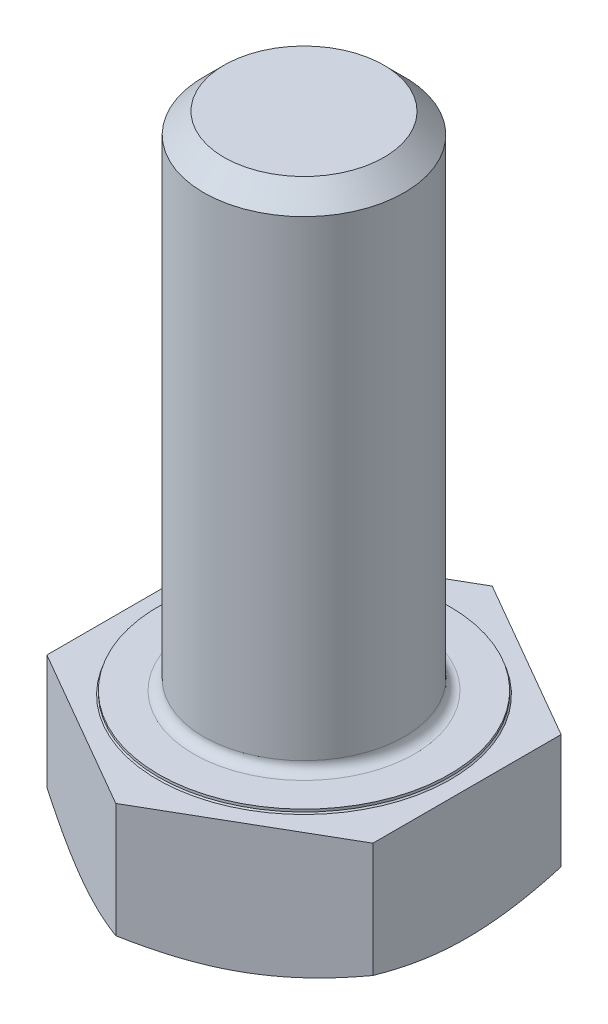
ISO-10303-21;
HEADER;
FILE_DESCRIPTION(('STEP AP214'),'2;1');
FILE_NAME('part.step','',(''),(''),'','','');
FILE_SCHEMA(('AUTOMOTIVE_DESIGN { 1 0 10303 214 1 1 1 1 }'));
ENDSEC;
DATA;
#1=APPLICATION_CONTEXT('core data for automotive mechanical design processes');
#2=APPLICATION_PROTOCOL_DEFINITION('international standard','automotive_design',2000,#1);
#3=PRODUCT_CONTEXT('',#1,'mechanical');
#4=PRODUCT('Part','Part','',(#3));
#5=PRODUCT_RELATED_PRODUCT_CATEGORY('part','',(#4));
#6=PRODUCT_DEFINITION_FORMATION('','',#4);
#7=PRODUCT_DEFINITION_CONTEXT('part definition',#1,'design');
#8=PRODUCT_DEFINITION('design','',#6,#7);
#9=PRODUCT_DEFINITION_SHAPE('','',#8);
#10=(LENGTH_UNIT() NAMED_UNIT(*) SI_UNIT(.MILLI.,.METRE.));
#11=(NAMED_UNIT(*) PLANE_ANGLE_UNIT() SI_UNIT($,.RADIAN.));
#12=(NAMED_UNIT(*) SI_UNIT($,.STERADIAN.) SOLID_ANGLE_UNIT());
#13=UNCERTAINTY_MEASURE_WITH_UNIT(LENGTH_MEASURE(1.E-05),#10,'distance_accuracy_value','');
#14=(GEOMETRIC_REPRESENTATION_CONTEXT(3) GLOBAL_UNCERTAINTY_ASSIGNED_CONTEXT((#13)) GLOBAL_UNIT_ASSIGNED_CONTEXT((#10,
#11,#12)) REPRESENTATION_CONTEXT('',''));
#15=CARTESIAN_POINT('',(0.,0.,0.));
#16=DIRECTION('',(0.,0.,1.));
#17=DIRECTION('',(1.,0.,0.));
#18=AXIS2_PLACEMENT_3D('',#15,#16,#17);
#19=CARTESIAN_POINT('',(0.,-5.3,0.));
#20=DIRECTION('',(0.,-1.,0.));
#21=DIRECTION('',(0.,0.,-1.));
#22=AXIS2_PLACEMENT_3D('',#19,#20,#21);
#23=PLANE('',#22);
#24=CARTESIAN_POINT('',(0.,-5.30000000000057,0.));
#25=DIRECTION('',(0.,1.,0.));
#26=DIRECTION('',(0.,0.,1.));
#27=AXIS2_PLACEMENT_3D('',#24,#25,#26);
#28=CIRCLE('',#27,6.50000000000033);
#29=CARTESIAN_POINT('',(-6.5,-5.30000000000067,2.10460441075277E-10));
#30=VERTEX_POINT('',#29);
#31=CARTESIAN_POINT('',(-3.2500000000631,-5.30000000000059,5.62916512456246));
#32=VERTEX_POINT('',#31);
#33=EDGE_CURVE('E174',#30,#32,#28,.T.);
#34=ORIENTED_EDGE('',*,*,#33,.F.);
#35=CARTESIAN_POINT('',(0.,-5.30000000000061,0.));
#36=DIRECTION('',(0.,1.,0.));
#37=DIRECTION('',(0.,0.,1.));
#38=AXIS2_PLACEMENT_3D('',#35,#36,#37);
#39=CIRCLE('',#38,6.50000000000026);
#40=CARTESIAN_POINT('',(-3.2500000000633,-5.30000000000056,-5.62916512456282));
#41=VERTEX_POINT('',#40);
#42=EDGE_CURVE('E59',#41,#30,#39,.T.);
#43=ORIENTED_EDGE('',*,*,#42,.F.);
#44=CARTESIAN_POINT('',(0.,-5.30000000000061,0.));
#45=DIRECTION('',(0.,1.,0.));
#46=DIRECTION('',(0.,0.,1.));
#47=AXIS2_PLACEMENT_3D('',#44,#45,#46);
#48=CIRCLE('',#47,6.50000000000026);
#49=CARTESIAN_POINT('',(3.25000000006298,-5.30000000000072,-5.62916512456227));
#50=VERTEX_POINT('',#49);
#51=EDGE_CURVE('E76',#50,#41,#48,.T.);
#52=ORIENTED_EDGE('',*,*,#51,.F.);
#53=CARTESIAN_POINT('',(0.,-5.30000000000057,0.));
#54=DIRECTION('',(0.,1.,0.));
#55=DIRECTION('',(0.,0.,1.));
#56=AXIS2_PLACEMENT_3D('',#53,#54,#55);
#57=CIRCLE('',#56,6.50000000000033);
#58=CARTESIAN_POINT('',(6.50000000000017,-5.30000000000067,-1.5783853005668E-10));
#59=VERTEX_POINT('',#58);
#60=EDGE_CURVE('E74',#59,#50,#57,.T.);
#61=ORIENTED_EDGE('',*,*,#60,.F.);
#62=CARTESIAN_POINT('',(0.,-5.30000000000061,0.));
#63=DIRECTION('',(0.,1.,0.));
#64=DIRECTION('',(0.,0.,1.));
#65=AXIS2_PLACEMENT_3D('',#62,#63,#64);
#66=CIRCLE('',#65,6.50000000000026);
#67=CARTESIAN_POINT('',(3.2500000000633,-5.30000000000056,5.62916512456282));
#68=VERTEX_POINT('',#67);
#69=EDGE_CURVE('E175',#68,#59,#66,.T.);
#70=ORIENTED_EDGE('',*,*,#69,.F.);
#71=CARTESIAN_POINT('',(0.,-5.30000000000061,0.));
#72=DIRECTION('',(0.,1.,0.));
#73=DIRECTION('',(0.,0.,1.));
#74=AXIS2_PLACEMENT_3D('',#71,#72,#73);
#75=CIRCLE('',#74,6.50000000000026);
#76=EDGE_CURVE('E170',#32,#68,#75,.T.);
#77=ORIENTED_EDGE('',*,*,#76,.F.);
#78=EDGE_LOOP('',(#34,#43,#52,#61,#70,#77));
#79=FACE_BOUND('',#78,.T.);
#80=ADVANCED_FACE('F42',(#79),#23,.T.);
#81=CARTESIAN_POINT('',(0.,-4.71596007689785,0.));
#82=DIRECTION('',(0.,1.,0.));
#83=DIRECTION('',(0.,0.,1.));
#84=AXIS2_PLACEMENT_3D('',#81,#82,#83);
#85=CONICAL_SURFACE('',#84,7.51158682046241,1.0471975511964);
#86=CARTESIAN_POINT('',(6.4999999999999,-4.71944341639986,-3.75277674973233));
#87=CARTESIAN_POINT('',(6.23545138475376,-4.8076484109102,-3.90551396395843));
#88=CARTESIAN_POINT('',(5.96878416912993,-4.88845958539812,-4.0594743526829));
#89=CARTESIAN_POINT('',(5.43309909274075,-5.0309686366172,-4.36875227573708));
#90=CARTESIAN_POINT('',(5.16409991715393,-5.09276102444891,-4.52405902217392));
#91=CARTESIAN_POINT('',(4.75806245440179,-5.16863158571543,-4.75848486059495));
#92=CARTESIAN_POINT('',(4.62220372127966,-5.19112797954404,-4.83692293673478));
#93=CARTESIAN_POINT('',(4.34983584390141,-5.23006970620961,-4.99417460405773));
#94=CARTESIAN_POINT('',(4.21332671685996,-5.24651519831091,-5.07298818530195));
#95=CARTESIAN_POINT('',(3.93915312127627,-5.27306617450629,-5.23128238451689));
#96=CARTESIAN_POINT('',(3.80148629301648,-5.28313941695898,-5.31076436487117));
#97=CARTESIAN_POINT('',(3.52588189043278,-5.29662027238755,-5.46988464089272));
#98=CARTESIAN_POINT('',(3.38794426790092,-5.3000265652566,-5.54952296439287));
#99=CARTESIAN_POINT('',(3.25000000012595,-5.30000000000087,-5.62916512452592));
#100=B_SPLINE_CURVE_WITH_KNOTS('',3,(#86,#87,#88,#89,#90,#91,#92,#93,#94,#95,#96,#97,#98,#99),
.UNSPECIFIED.,.F.,.F.,(4,2,2,2,2,2,4),(0.,0.95424765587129,1.90367376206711,2.37900973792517,
2.85433320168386,3.33204281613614,3.80984701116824),.UNSPECIFIED.);
#101=CARTESIAN_POINT('',(6.5,-4.71944341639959,-3.752776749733));
#102=VERTEX_POINT('',#101);
#103=EDGE_CURVE('E159',#102,#50,#100,.T.);
#104=ORIENTED_EDGE('',*,*,#103,.F.);
#105=CARTESIAN_POINT('',(6.5,-5.30000000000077,-3.1567745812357E-10));
#106=CARTESIAN_POINT('',(6.5,-5.30002656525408,-0.159284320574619));
#107=CARTESIAN_POINT('',(6.5,-5.29662027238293,-0.318560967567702));
#108=CARTESIAN_POINT('',(6.5,-5.2831394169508,-0.636801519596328));
#109=CARTESIAN_POINT('',(6.5,-5.27306617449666,-0.795765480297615));
#110=CARTESIAN_POINT('',(6.5,-5.24651519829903,-1.11235387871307));
#111=CARTESIAN_POINT('',(6.5,-5.23006970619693,-1.26998104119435));
#112=CARTESIAN_POINT('',(6.5,-5.19112797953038,-1.58448437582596));
#113=CARTESIAN_POINT('',(6.5,-5.1686315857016,-1.74136052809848));
#114=CARTESIAN_POINT('',(6.5,-5.09276102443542,-2.2102122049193));
#115=CARTESIAN_POINT('',(6.5,-5.0309686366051,-2.52082569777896));
#116=CARTESIAN_POINT('',(6.5,-4.88845958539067,-3.13938154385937));
#117=CARTESIAN_POINT('',(6.5,-4.80764841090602,-3.4473023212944));
#118=CARTESIAN_POINT('',(6.5,-4.71944341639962,-3.75277674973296));
#119=B_SPLINE_CURVE_WITH_KNOTS('',3,(#105,#106,#107,#108,#109,#110,#111,#112,#113,#114,#115,
#116,#117,#118),.UNSPECIFIED.,.F.,.F.,(4,2,2,2,2,2,4),(0.,0.477804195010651,0.95551380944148,
1.4308372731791,1.90617324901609,2.85559935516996,3.80984701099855),.UNSPECIFIED.);
#120=EDGE_CURVE('E309',#59,#102,#119,.T.);
#121=ORIENTED_EDGE('',*,*,#120,.F.);
#122=ORIENTED_EDGE('',*,*,#60,.T.);
#123=EDGE_LOOP('',(#104,#121,#122));
#124=FACE_BOUND('',#123,.T.);
#125=ADVANCED_FACE('F315',(#124),#85,.T.);
#126=CARTESIAN_POINT('',(0.,-4.71596007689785,0.));
#127=DIRECTION('',(0.,1.,0.));
#128=DIRECTION('',(0.,0.,1.));
#129=AXIS2_PLACEMENT_3D('',#126,#127,#128);
#130=CONICAL_SURFACE('',#129,7.51158682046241,1.0471975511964);
#131=CARTESIAN_POINT('',(6.5,-4.71944341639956,3.75277674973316));
#132=CARTESIAN_POINT('',(6.5,-4.80764841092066,3.44730232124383));
#133=CARTESIAN_POINT('',(6.5,-4.88845958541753,3.13938154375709));
#134=CARTESIAN_POINT('',(6.5,-5.03096863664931,2.52082569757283));
#135=CARTESIAN_POINT('',(6.5,-5.09276102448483,2.21021220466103));
#136=CARTESIAN_POINT('',(6.5,-5.16863158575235,1.74136052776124));
#137=CARTESIAN_POINT('',(6.5,-5.1911279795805,1.5844843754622));
#138=CARTESIAN_POINT('',(6.5,-5.23006970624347,1.26998104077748));
#139=CARTESIAN_POINT('',(6.5,-5.24651519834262,1.11235387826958));
#140=CARTESIAN_POINT('',(6.5,-5.27306617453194,0.79576547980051));
#141=CARTESIAN_POINT('',(6.5,-5.2831394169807,0.636801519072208));
#142=CARTESIAN_POINT('',(6.5,-5.29662027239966,0.318560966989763));
#143=CARTESIAN_POINT('',(6.5,-5.30002656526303,0.159284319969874));
#144=CARTESIAN_POINT('',(6.5,-5.30000000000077,-3.15677758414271E-10));
#145=B_SPLINE_CURVE_WITH_KNOTS('',3,(#131,#132,#133,#134,#135,#136,#137,#138,#139,#140,#141,
#142,#143,#144),.UNSPECIFIED.,.F.,.F.,(4,2,2,2,2,2,4),(0.,0.954247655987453,1.90367376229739,
2.37900973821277,2.8543332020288,3.33204281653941,3.80984701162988),.UNSPECIFIED.);
#146=CARTESIAN_POINT('',(6.5,-4.71944341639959,3.752776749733));
#147=VERTEX_POINT('',#146);
#148=EDGE_CURVE('E269',#147,#59,#145,.T.);
#149=ORIENTED_EDGE('',*,*,#148,.F.);
#150=CARTESIAN_POINT('',(3.25000000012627,-5.30000000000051,5.62916512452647));
#151=CARTESIAN_POINT('',(3.38794426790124,-5.30002656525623,5.54952296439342));
#152=CARTESIAN_POINT('',(3.52588189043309,-5.29662027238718,5.46988464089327));
#153=CARTESIAN_POINT('',(3.80148629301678,-5.28313941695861,5.31076436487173));
#154=CARTESIAN_POINT('',(3.93915312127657,-5.27306617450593,5.23128238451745));
#155=CARTESIAN_POINT('',(4.21332671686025,-5.24651519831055,5.07298818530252));
#156=CARTESIAN_POINT('',(4.3498358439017,-5.23006970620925,4.9941746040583));
#157=CARTESIAN_POINT('',(4.62220372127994,-5.19112797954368,4.83692293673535));
#158=CARTESIAN_POINT('',(4.75806245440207,-5.16863158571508,4.75848486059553));
#159=CARTESIAN_POINT('',(5.1640999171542,-5.09276102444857,4.5240590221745));
#160=CARTESIAN_POINT('',(5.43309909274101,-5.03096863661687,4.36875227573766));
#161=CARTESIAN_POINT('',(5.96878416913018,-4.88845958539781,4.05947435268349));
#162=CARTESIAN_POINT('',(6.23545138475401,-4.80764841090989,3.90551396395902));
#163=CARTESIAN_POINT('',(6.50000000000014,-4.71944341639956,3.75277674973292));
#164=B_SPLINE_CURVE_WITH_KNOTS('',3,(#150,#151,#152,#153,#154,#155,#156,#157,#158,#159,#160,
#161,#162,#163),.UNSPECIFIED.,.F.,.F.,(4,2,2,2,2,2,4),(0.,0.477804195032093,0.955513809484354,
1.43083727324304,1.90617324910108,2.85559935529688,3.80984701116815),.UNSPECIFIED.);
#165=EDGE_CURVE('E244',#68,#147,#164,.T.);
#166=ORIENTED_EDGE('',*,*,#165,.F.);
#167=ORIENTED_EDGE('',*,*,#69,.T.);
#168=EDGE_LOOP('',(#149,#166,#167));
#169=FACE_BOUND('',#168,.T.);
#170=ADVANCED_FACE('F277',(#169),#130,.T.);
#171=CARTESIAN_POINT('',(0.,-4.715960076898,0.));
#172=DIRECTION('',(0.,1.,0.));
#173=DIRECTION('',(0.,0.,1.));
#174=AXIS2_PLACEMENT_3D('',#171,#172,#173);
#175=CONICAL_SURFACE('',#174,7.51158682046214,1.0471975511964);
#176=CARTESIAN_POINT('',(1.59622624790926E-13,-4.71944341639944,7.50555349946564));
#177=CARTESIAN_POINT('',(0.264548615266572,-4.80764841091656,7.35281628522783));
#178=CARTESIAN_POINT('',(0.531215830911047,-4.88845958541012,7.19885589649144));
#179=CARTESIAN_POINT('',(1.0669009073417,-5.03096863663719,6.88957797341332));
#180=CARTESIAN_POINT('',(1.33590008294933,-5.0927610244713,6.73427122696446));
#181=CARTESIAN_POINT('',(1.741937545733,-5.16863158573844,6.49984538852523));
#182=CARTESIAN_POINT('',(1.87779627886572,-5.19112797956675,6.42140731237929));
#183=CARTESIAN_POINT('',(2.15016415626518,-5.23006970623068,6.26415564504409));
#184=CARTESIAN_POINT('',(2.28667328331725,-5.24651519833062,6.18534206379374));
#185=CARTESIAN_POINT('',(2.56084687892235,-5.27306617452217,6.02704786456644));
#186=CARTESIAN_POINT('',(2.69851370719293,-5.28313941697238,5.94756588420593));
#187=CARTESIAN_POINT('',(2.97411810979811,-5.29662027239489,5.78844560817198));
#188=CARTESIAN_POINT('',(3.11205573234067,-5.30002656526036,5.70880728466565));
#189=CARTESIAN_POINT('',(3.25000000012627,-5.30000000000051,5.62916512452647));
#190=B_SPLINE_CURVE_WITH_KNOTS('',3,(#176,#177,#178,#179,#180,#181,#182,#183,#184,#185,#186,
#187,#188,#189),.UNSPECIFIED.,.F.,.F.,(4,2,2,2,2,2,4),(0.,0.954247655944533,1.90367376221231,
2.37900973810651,2.85433320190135,3.33204281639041,3.80984701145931),.UNSPECIFIED.);
#191=CARTESIAN_POINT('',(3.05528172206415E-13,-4.71944341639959,7.50555349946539));
#192=VERTEX_POINT('',#191);
#193=EDGE_CURVE('E287',#192,#68,#190,.T.);
#194=ORIENTED_EDGE('',*,*,#193,.F.);
#195=CARTESIAN_POINT('',(-3.25000000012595,-5.30000000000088,5.62916512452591));
#196=CARTESIAN_POINT('',(-3.11205573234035,-5.30002656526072,5.7088072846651));
#197=CARTESIAN_POINT('',(-2.97411810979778,-5.29662027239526,5.78844560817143));
#198=CARTESIAN_POINT('',(-2.69851370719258,-5.28313941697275,5.9475658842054));
#199=CARTESIAN_POINT('',(-2.56084687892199,-5.27306617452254,6.02704786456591));
#200=CARTESIAN_POINT('',(-2.28667328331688,-5.24651519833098,6.18534206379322));
#201=CARTESIAN_POINT('',(-2.1501641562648,-5.23006970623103,6.26415564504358));
#202=CARTESIAN_POINT('',(-1.87779627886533,-5.1911279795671,6.42140731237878));
#203=CARTESIAN_POINT('',(-1.74193754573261,-5.16863158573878,6.49984538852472));
#204=CARTESIAN_POINT('',(-1.33590008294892,-5.09276102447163,6.73427122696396));
#205=CARTESIAN_POINT('',(-1.06690090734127,-5.03096863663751,6.88957797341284));
#206=CARTESIAN_POINT('',(-0.531215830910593,-4.88845958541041,7.19885589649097));
#207=CARTESIAN_POINT('',(-0.264548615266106,-4.80764841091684,7.35281628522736));
#208=CARTESIAN_POINT('',(3.19048404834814E-13,-4.71944341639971,7.50555349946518));
#209=B_SPLINE_CURVE_WITH_KNOTS('',3,(#195,#196,#197,#198,#199,#200,#201,#202,#203,#204,#205,
#206,#207,#208),.UNSPECIFIED.,.F.,.F.,(4,2,2,2,2,2,4),(0.,0.477804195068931,0.955513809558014,
1.43083727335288,1.90617324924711,2.85559935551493,3.80984701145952),.UNSPECIFIED.);
#210=EDGE_CURVE('E243',#32,#192,#209,.T.);
#211=ORIENTED_EDGE('',*,*,#210,.F.);
#212=ORIENTED_EDGE('',*,*,#76,.T.);
#213=EDGE_LOOP('',(#194,#211,#212));
#214=FACE_BOUND('',#213,.T.);
#215=ADVANCED_FACE('F273',(#214),#175,.T.);
#216=CARTESIAN_POINT('',(0.,-4.71596007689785,0.));
#217=DIRECTION('',(0.,1.,0.));
#218=DIRECTION('',(0.,0.,1.));
#219=AXIS2_PLACEMENT_3D('',#216,#217,#218);
#220=CONICAL_SURFACE('',#219,7.51158682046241,1.0471975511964);
#221=CARTESIAN_POINT('',(-6.4999999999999,-4.71944341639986,3.75277674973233));
#222=CARTESIAN_POINT('',(-6.23545138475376,-4.8076484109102,3.90551396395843));
#223=CARTESIAN_POINT('',(-5.96878416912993,-4.88845958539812,4.05947435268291));
#224=CARTESIAN_POINT('',(-5.43309909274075,-5.0309686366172,4.36875227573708));
#225=CARTESIAN_POINT('',(-5.16409991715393,-5.09276102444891,4.52405902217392));
#226=CARTESIAN_POINT('',(-4.75806245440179,-5.16863158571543,4.75848486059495));
#227=CARTESIAN_POINT('',(-4.62220372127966,-5.19112797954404,4.83692293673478));
#228=CARTESIAN_POINT('',(-4.34983584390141,-5.23006970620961,4.99417460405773));
#229=CARTESIAN_POINT('',(-4.21332671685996,-5.24651519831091,5.07298818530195));
#230=CARTESIAN_POINT('',(-3.93915312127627,-5.27306617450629,5.23128238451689));
#231=CARTESIAN_POINT('',(-3.80148629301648,-5.28313941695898,5.31076436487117));
#232=CARTESIAN_POINT('',(-3.52588189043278,-5.29662027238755,5.46988464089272));
#233=CARTESIAN_POINT('',(-3.38794426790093,-5.3000265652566,5.54952296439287));
#234=CARTESIAN_POINT('',(-3.25000000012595,-5.30000000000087,5.62916512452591));
#235=B_SPLINE_CURVE_WITH_KNOTS('',3,(#221,#222,#223,#224,#225,#226,#227,#228,#229,#230,#231,
#232,#233,#234),.UNSPECIFIED.,.F.,.F.,(4,2,2,2,2,2,4),(0.,0.954247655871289,1.90367376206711,
2.37900973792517,2.85433320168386,3.33204281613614,3.80984701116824),.UNSPECIFIED.);
#236=CARTESIAN_POINT('',(-6.4999999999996,-4.71944341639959,3.75277674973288));
#237=VERTEX_POINT('',#236);
#238=EDGE_CURVE('E239',#237,#32,#235,.T.);
#239=ORIENTED_EDGE('',*,*,#238,.F.);
#240=CARTESIAN_POINT('',(-6.5,-5.30000000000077,4.20920882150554E-10));
#241=CARTESIAN_POINT('',(-6.5,-5.30002656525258,0.159284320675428));
#242=CARTESIAN_POINT('',(-6.5,-5.29662027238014,0.318560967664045));
#243=CARTESIAN_POINT('',(-6.5,-5.28313941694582,0.636801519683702));
#244=CARTESIAN_POINT('',(-6.5,-5.27306617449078,0.795765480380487));
#245=CARTESIAN_POINT('',(-6.5,-5.24651519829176,1.112353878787));
#246=CARTESIAN_POINT('',(-6.5,-5.23006970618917,1.26998104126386));
#247=CARTESIAN_POINT('',(-6.5,-5.19112797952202,1.58448437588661));
#248=CARTESIAN_POINT('',(-6.5,-5.16863158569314,1.74136052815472));
#249=CARTESIAN_POINT('',(-6.5,-5.09276102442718,2.21021220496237));
#250=CARTESIAN_POINT('',(-6.5,-5.03096863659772,2.52082569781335));
#251=CARTESIAN_POINT('',(-6.5,-4.88845958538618,3.13938154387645));
#252=CARTESIAN_POINT('',(-6.5,-4.80764841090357,3.44730232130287));
#253=CARTESIAN_POINT('',(-6.5,-4.71944341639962,3.75277674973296));
#254=B_SPLINE_CURVE_WITH_KNOTS('',3,(#240,#241,#242,#243,#244,#245,#246,#247,#248,#249,#250,
#251,#252,#253),.UNSPECIFIED.,.F.,.F.,(4,2,2,2,2,2,4),(0.,0.47780419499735,0.955513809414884,
1.43083727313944,1.90617324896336,2.85559935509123,3.80984701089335),.UNSPECIFIED.);
#255=EDGE_CURVE('E250',#30,#237,#254,.T.);
#256=ORIENTED_EDGE('',*,*,#255,.F.);
#257=ORIENTED_EDGE('',*,*,#33,.T.);
#258=EDGE_LOOP('',(#239,#256,#257));
#259=FACE_BOUND('',#258,.T.);
#260=ADVANCED_FACE('F207',(#259),#220,.T.);
#261=CARTESIAN_POINT('',(0.,-4.715960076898,0.));
#262=DIRECTION('',(0.,1.,0.));
#263=DIRECTION('',(0.,0.,1.));
#264=AXIS2_PLACEMENT_3D('',#261,#262,#263);
#265=CONICAL_SURFACE('',#264,7.51158682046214,1.0471975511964);
#266=CARTESIAN_POINT('',(-2.0328948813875E-13,-4.71944341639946,-7.50555349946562));
#267=CARTESIAN_POINT('',(-0.264548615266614,-4.80764841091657,-7.35281628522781));
#268=CARTESIAN_POINT('',(-0.531215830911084,-4.88845958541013,-7.19885589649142));
#269=CARTESIAN_POINT('',(-1.06690090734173,-5.0309686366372,-6.88957797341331));
#270=CARTESIAN_POINT('',(-1.33590008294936,-5.0927610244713,-6.73427122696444));
#271=CARTESIAN_POINT('',(-1.74193754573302,-5.16863158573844,-6.49984538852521));
#272=CARTESIAN_POINT('',(-1.87779627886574,-5.19112797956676,-6.42140731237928));
#273=CARTESIAN_POINT('',(-2.15016415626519,-5.23006970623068,-6.26415564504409));
#274=CARTESIAN_POINT('',(-2.28667328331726,-5.24651519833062,-6.18534206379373));
#275=CARTESIAN_POINT('',(-2.56084687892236,-5.27306617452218,-6.02704786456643));
#276=CARTESIAN_POINT('',(-2.69851370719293,-5.28313941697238,-5.94756588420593));
#277=CARTESIAN_POINT('',(-2.97411810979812,-5.29662027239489,-5.78844560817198));
#278=CARTESIAN_POINT('',(-3.11205573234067,-5.30002656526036,-5.70880728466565));
#279=CARTESIAN_POINT('',(-3.25000000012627,-5.30000000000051,-5.62916512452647));
#280=B_SPLINE_CURVE_WITH_KNOTS('',3,(#266,#267,#268,#269,#270,#271,#272,#273,#274,#275,#276,
#277,#278,#279),.UNSPECIFIED.,.F.,.F.,(4,2,2,2,2,2,4),(0.,0.95424765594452,1.90367376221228,
2.37900973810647,2.85433320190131,3.33204281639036,3.80984701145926),.UNSPECIFIED.);
#281=CARTESIAN_POINT('',(2.4611389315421E-13,-4.71944341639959,-7.50555349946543));
#282=VERTEX_POINT('',#281);
#283=EDGE_CURVE('E196',#282,#41,#280,.T.);
#284=ORIENTED_EDGE('',*,*,#283,.F.);
#285=CARTESIAN_POINT('',(3.25000000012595,-5.30000000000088,-5.62916512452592));
#286=CARTESIAN_POINT('',(3.11205573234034,-5.30002656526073,-5.70880728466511));
#287=CARTESIAN_POINT('',(2.97411810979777,-5.29662027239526,-5.78844560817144));
#288=CARTESIAN_POINT('',(2.69851370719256,-5.28313941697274,-5.94756588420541));
#289=CARTESIAN_POINT('',(2.56084687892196,-5.27306617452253,-6.02704786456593));
#290=CARTESIAN_POINT('',(2.28667328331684,-5.24651519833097,-6.18534206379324));
#291=CARTESIAN_POINT('',(2.15016415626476,-5.23006970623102,-6.2641556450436));
#292=CARTESIAN_POINT('',(1.87779627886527,-5.19112797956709,-6.42140731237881));
#293=CARTESIAN_POINT('',(1.74193754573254,-5.16863158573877,-6.49984538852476));
#294=CARTESIAN_POINT('',(1.33590008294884,-5.09276102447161,-6.73427122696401));
#295=CARTESIAN_POINT('',(1.06690090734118,-5.03096863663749,-6.88957797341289));
#296=CARTESIAN_POINT('',(0.53121583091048,-4.88845958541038,-7.19885589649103));
#297=CARTESIAN_POINT('',(0.264548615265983,-4.8076484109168,-7.35281628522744));
#298=CARTESIAN_POINT('',(-4.5183790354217E-13,-4.71944341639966,-7.50555349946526));
#299=B_SPLINE_CURVE_WITH_KNOTS('',3,(#285,#286,#287,#288,#289,#290,#291,#292,#293,#294,#295,
#296,#297,#298),.UNSPECIFIED.,.F.,.F.,(4,2,2,2,2,2,4),(0.,0.477804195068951,0.955513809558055,
1.43083727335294,1.90617324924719,2.85559935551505,3.80984701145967),.UNSPECIFIED.);
#300=EDGE_CURVE('E144',#50,#282,#299,.T.);
#301=ORIENTED_EDGE('',*,*,#300,.F.);
#302=ORIENTED_EDGE('',*,*,#51,.T.);
#303=EDGE_LOOP('',(#284,#301,#302));
#304=FACE_BOUND('',#303,.T.);
#305=ADVANCED_FACE('F202',(#304),#265,.T.);
#306=CARTESIAN_POINT('',(0.,-4.71596007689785,0.));
#307=DIRECTION('',(0.,1.,0.));
#308=DIRECTION('',(0.,0.,1.));
#309=AXIS2_PLACEMENT_3D('',#306,#307,#308);
#310=CONICAL_SURFACE('',#309,7.51158682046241,1.0471975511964);
#311=CARTESIAN_POINT('',(-6.5,-4.71944341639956,-3.75277674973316));
#312=CARTESIAN_POINT('',(-6.5,-4.80764841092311,-3.44730232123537));
#313=CARTESIAN_POINT('',(-6.5,-4.88845958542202,-3.13938154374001));
#314=CARTESIAN_POINT('',(-6.5,-5.03096863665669,-2.52082569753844));
#315=CARTESIAN_POINT('',(-6.5,-5.09276102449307,-2.21021220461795));
#316=CARTESIAN_POINT('',(-6.5,-5.16863158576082,-1.74136052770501));
#317=CARTESIAN_POINT('',(-6.5,-5.19112797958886,-1.58448437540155));
#318=CARTESIAN_POINT('',(-6.5,-5.23006970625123,-1.26998104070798));
#319=CARTESIAN_POINT('',(-6.5,-5.24651519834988,-1.11235387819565));
#320=CARTESIAN_POINT('',(-6.5,-5.27306617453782,-0.795765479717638));
#321=CARTESIAN_POINT('',(-6.5,-5.28313941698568,-0.636801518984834));
#322=CARTESIAN_POINT('',(-6.5,-5.29662027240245,-0.318560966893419));
#323=CARTESIAN_POINT('',(-6.5,-5.30002656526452,-0.159284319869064));
#324=CARTESIAN_POINT('',(-6.5,-5.30000000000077,4.20922107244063E-10));
#325=B_SPLINE_CURVE_WITH_KNOTS('',3,(#311,#312,#313,#314,#315,#316,#317,#318,#319,#320,#321,
#322,#323,#324),.UNSPECIFIED.,.F.,.F.,(4,2,2,2,2,2,4),(0.,0.954247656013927,1.90367376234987,
2.37900973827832,2.85433320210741,3.33204281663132,3.80984701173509),.UNSPECIFIED.);
#326=CARTESIAN_POINT('',(-6.5,-4.71944341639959,-3.752776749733));
#327=VERTEX_POINT('',#326);
#328=EDGE_CURVE('E219',#327,#30,#325,.T.);
#329=ORIENTED_EDGE('',*,*,#328,.F.);
#330=CARTESIAN_POINT('',(-3.25000000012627,-5.30000000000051,-5.62916512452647));
#331=CARTESIAN_POINT('',(-3.38794426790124,-5.30002656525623,-5.54952296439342));
#332=CARTESIAN_POINT('',(-3.52588189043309,-5.29662027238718,-5.46988464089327));
#333=CARTESIAN_POINT('',(-3.80148629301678,-5.28313941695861,-5.31076436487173));
#334=CARTESIAN_POINT('',(-3.93915312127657,-5.27306617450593,-5.23128238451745));
#335=CARTESIAN_POINT('',(-4.21332671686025,-5.24651519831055,-5.07298818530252));
#336=CARTESIAN_POINT('',(-4.3498358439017,-5.23006970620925,-4.9941746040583));
#337=CARTESIAN_POINT('',(-4.62220372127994,-5.19112797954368,-4.83692293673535));
#338=CARTESIAN_POINT('',(-4.75806245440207,-5.16863158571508,-4.75848486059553));
#339=CARTESIAN_POINT('',(-5.1640999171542,-5.09276102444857,-4.5240590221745));
#340=CARTESIAN_POINT('',(-5.43309909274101,-5.03096863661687,-4.36875227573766));
#341=CARTESIAN_POINT('',(-5.96878416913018,-4.88845958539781,-4.05947435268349));
#342=CARTESIAN_POINT('',(-6.23545138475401,-4.8076484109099,-3.90551396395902));
#343=CARTESIAN_POINT('',(-6.50000000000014,-4.71944341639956,-3.75277674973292));
#344=B_SPLINE_CURVE_WITH_KNOTS('',3,(#330,#331,#332,#333,#334,#335,#336,#337,#338,#339,#340,
#341,#342,#343),.UNSPECIFIED.,.F.,.F.,(4,2,2,2,2,2,4),(0.,0.477804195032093,0.955513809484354,
1.43083727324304,1.90617324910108,2.85559935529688,3.80984701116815),.UNSPECIFIED.);
#345=EDGE_CURVE('E238',#41,#327,#344,.T.);
#346=ORIENTED_EDGE('',*,*,#345,.F.);
#347=ORIENTED_EDGE('',*,*,#42,.T.);
#348=EDGE_LOOP('',(#329,#346,#347));
#349=FACE_BOUND('',#348,.T.);
#350=ADVANCED_FACE('F206',(#349),#310,.T.);
#351=CARTESIAN_POINT('',(0.,0.,-7.505553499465));
#352=DIRECTION('',(0.500000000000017,0.,-0.866025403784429));
#353=DIRECTION('',(-0.866025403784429,0.,-0.500000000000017));
#354=AXIS2_PLACEMENT_3D('',#351,#352,#353);
#355=PLANE('',#354);
#356=ORIENTED_EDGE('',*,*,#300,.T.);
#357=DIRECTION('',(0.,-1.,0.));
#358=VECTOR('',#357,1.);
#359=CARTESIAN_POINT('',(2.4611389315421E-13,-0.15,-7.50555349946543));
#360=LINE('',#359,#358);
#361=CARTESIAN_POINT('',(2.4611389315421E-13,-0.15,-7.50555349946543));
#362=VERTEX_POINT('',#361);
#363=EDGE_CURVE('E140',#362,#282,#360,.T.);
#364=ORIENTED_EDGE('',*,*,#363,.F.);
#365=DIRECTION('',(-0.866025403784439,0.,-0.5));
#366=VECTOR('',#365,1.);
#367=CARTESIAN_POINT('',(2.4611389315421E-13,-0.15,-7.50555349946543));
#368=LINE('',#367,#366);
#369=CARTESIAN_POINT('',(6.5,-0.15,-3.752776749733));
#370=VERTEX_POINT('',#369);
#371=EDGE_CURVE('E129',#370,#362,#368,.T.);
#372=ORIENTED_EDGE('',*,*,#371,.F.);
#373=DIRECTION('',(0.,-1.,0.));
#374=VECTOR('',#373,1.);
#375=CARTESIAN_POINT('',(6.5,-0.15,-3.752776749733));
#376=LINE('',#375,#374);
#377=EDGE_CURVE('E148',#370,#102,#376,.T.);
#378=ORIENTED_EDGE('',*,*,#377,.T.);
#379=ORIENTED_EDGE('',*,*,#103,.T.);
#380=EDGE_LOOP('',(#356,#364,#372,#378,#379));
#381=FACE_BOUND('',#380,.T.);
#382=ADVANCED_FACE('F141',(#381),#355,.T.);
#383=CARTESIAN_POINT('',(6.5,0.,-3.752776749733));
#384=DIRECTION('',(1.,0.,0.));
#385=DIRECTION('',(0.,0.,-1.));
#386=AXIS2_PLACEMENT_3D('',#383,#384,#385);
#387=PLANE('',#386);
#388=ORIENTED_EDGE('',*,*,#120,.T.);
#389=ORIENTED_EDGE('',*,*,#377,.F.);
#390=DIRECTION('',(0.,0.,-1.));
#391=VECTOR('',#390,1.);
#392=CARTESIAN_POINT('',(6.5,-0.15,-3.752776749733));
#393=LINE('',#392,#391);
#394=CARTESIAN_POINT('',(6.5,-0.15,3.752776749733));
#395=VERTEX_POINT('',#394);
#396=EDGE_CURVE('E135',#395,#370,#393,.T.);
#397=ORIENTED_EDGE('',*,*,#396,.F.);
#398=DIRECTION('',(0.,-1.,0.));
#399=VECTOR('',#398,1.);
#400=CARTESIAN_POINT('',(6.5,-0.15,3.752776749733));
#401=LINE('',#400,#399);
#402=EDGE_CURVE('E703',#395,#147,#401,.T.);
#403=ORIENTED_EDGE('',*,*,#402,.T.);
#404=ORIENTED_EDGE('',*,*,#148,.T.);
#405=EDGE_LOOP('',(#388,#389,#397,#403,#404));
#406=FACE_BOUND('',#405,.T.);
#407=ADVANCED_FACE('F313',(#406),#387,.T.);
#408=CARTESIAN_POINT('',(6.5,0.,3.752776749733));
#409=DIRECTION('',(0.500000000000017,0.,0.866025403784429));
#410=DIRECTION('',(0.866025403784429,0.,-0.500000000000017));
#411=AXIS2_PLACEMENT_3D('',#408,#409,#410);
#412=PLANE('',#411);
#413=ORIENTED_EDGE('',*,*,#165,.T.);
#414=ORIENTED_EDGE('',*,*,#402,.F.);
#415=DIRECTION('',(0.866025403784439,0.,-0.5));
#416=VECTOR('',#415,1.);
#417=CARTESIAN_POINT('',(6.5,-0.15,3.752776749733));
#418=LINE('',#417,#416);
#419=CARTESIAN_POINT('',(3.05528172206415E-13,-0.15,7.50555349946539));
#420=VERTEX_POINT('',#419);
#421=EDGE_CURVE('E122',#420,#395,#418,.T.);
#422=ORIENTED_EDGE('',*,*,#421,.F.);
#423=DIRECTION('',(0.,-1.,0.));
#424=VECTOR('',#423,1.);
#425=CARTESIAN_POINT('',(3.05528172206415E-13,-0.15,7.50555349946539));
#426=LINE('',#425,#424);
#427=EDGE_CURVE('E183',#420,#192,#426,.T.);
#428=ORIENTED_EDGE('',*,*,#427,.T.);
#429=ORIENTED_EDGE('',*,*,#193,.T.);
#430=EDGE_LOOP('',(#413,#414,#422,#428,#429));
#431=FACE_BOUND('',#430,.T.);
#432=ADVANCED_FACE('F258',(#431),#412,.T.);
#433=CARTESIAN_POINT('',(0.,0.,7.505553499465));
#434=DIRECTION('',(-0.500000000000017,0.,0.866025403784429));
#435=DIRECTION('',(0.866025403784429,0.,0.500000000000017));
#436=AXIS2_PLACEMENT_3D('',#433,#434,#435);
#437=PLANE('',#436);
#438=ORIENTED_EDGE('',*,*,#210,.T.);
#439=ORIENTED_EDGE('',*,*,#427,.F.);
#440=DIRECTION('',(0.866025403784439,0.,0.5));
#441=VECTOR('',#440,1.);
#442=CARTESIAN_POINT('',(3.05528172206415E-13,-0.15,7.50555349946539));
#443=LINE('',#442,#441);
#444=CARTESIAN_POINT('',(-6.4999999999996,-0.15,3.75277674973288));
#445=VERTEX_POINT('',#444);
#446=EDGE_CURVE('E717',#445,#420,#443,.T.);
#447=ORIENTED_EDGE('',*,*,#446,.F.);
#448=DIRECTION('',(0.,-1.,0.));
#449=VECTOR('',#448,1.);
#450=CARTESIAN_POINT('',(-6.4999999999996,-0.15,3.75277674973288));
#451=LINE('',#450,#449);
#452=EDGE_CURVE('E114',#445,#237,#451,.T.);
#453=ORIENTED_EDGE('',*,*,#452,.T.);
#454=ORIENTED_EDGE('',*,*,#238,.T.);
#455=EDGE_LOOP('',(#438,#439,#447,#453,#454));
#456=FACE_BOUND('',#455,.T.);
#457=ADVANCED_FACE('F254',(#456),#437,.T.);
#458=CARTESIAN_POINT('',(-6.5,0.,3.752776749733));
#459=DIRECTION('',(-1.,0.,0.));
#460=DIRECTION('',(0.,0.,1.));
#461=AXIS2_PLACEMENT_3D('',#458,#459,#460);
#462=PLANE('',#461);
#463=ORIENTED_EDGE('',*,*,#255,.T.);
#464=ORIENTED_EDGE('',*,*,#452,.F.);
#465=DIRECTION('',(0.,0.,1.));
#466=VECTOR('',#465,1.);
#467=CARTESIAN_POINT('',(-6.4999999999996,-0.15,3.75277674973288));
#468=LINE('',#467,#466);
#469=CARTESIAN_POINT('',(-6.4999999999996,-0.15,-3.75277674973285));
#470=VERTEX_POINT('',#469);
#471=EDGE_CURVE('E91',#470,#445,#468,.T.);
#472=ORIENTED_EDGE('',*,*,#471,.F.);
#473=DIRECTION('',(0.,-1.,0.));
#474=VECTOR('',#473,1.);
#475=CARTESIAN_POINT('',(-6.4999999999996,-0.15,-3.75277674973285));
#476=LINE('',#475,#474);
#477=EDGE_CURVE('E83',#470,#327,#476,.T.);
#478=ORIENTED_EDGE('',*,*,#477,.T.);
#479=ORIENTED_EDGE('',*,*,#328,.T.);
#480=EDGE_LOOP('',(#463,#464,#472,#478,#479));
#481=FACE_BOUND('',#480,.T.);
#482=ADVANCED_FACE('F227',(#481),#462,.T.);
#483=CARTESIAN_POINT('',(-6.5,0.,-3.752776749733));
#484=DIRECTION('',(-0.500000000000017,0.,-0.866025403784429));
#485=DIRECTION('',(-0.866025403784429,0.,0.500000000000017));
#486=AXIS2_PLACEMENT_3D('',#483,#484,#485);
#487=PLANE('',#486);
#488=ORIENTED_EDGE('',*,*,#345,.T.);
#489=ORIENTED_EDGE('',*,*,#477,.F.);
#490=DIRECTION('',(-0.866025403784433,0.,0.50000000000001));
#491=VECTOR('',#490,1.);
#492=CARTESIAN_POINT('',(-6.4999999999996,-0.15,-3.75277674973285));
#493=LINE('',#492,#491);
#494=EDGE_CURVE('E133',#362,#470,#493,.T.);
#495=ORIENTED_EDGE('',*,*,#494,.F.);
#496=ORIENTED_EDGE('',*,*,#363,.T.);
#497=ORIENTED_EDGE('',*,*,#283,.T.);
#498=EDGE_LOOP('',(#488,#489,#495,#496,#497));
#499=FACE_BOUND('',#498,.T.);
#500=ADVANCED_FACE('F151',(#499),#487,.T.);
#501=CARTESIAN_POINT('',(0.,-0.15,0.));
#502=DIRECTION('',(0.,-1.,0.));
#503=DIRECTION('',(0.,0.,-1.));
#504=AXIS2_PLACEMENT_3D('',#501,#502,#503);
#505=PLANE('',#504);
#506=CARTESIAN_POINT('',(0.,-0.15,0.));
#507=DIRECTION('',(0.,-1.,0.));
#508=DIRECTION('',(0.,0.,-1.));
#509=AXIS2_PLACEMENT_3D('',#506,#507,#508);
#510=CIRCLE('',#509,5.85000000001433);
#511=CARTESIAN_POINT('',(0.,-0.15,-5.85000000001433));
#512=VERTEX_POINT('',#511);
#513=EDGE_CURVE('E487',#512,#512,#510,.T.);
#514=ORIENTED_EDGE('',*,*,#513,.T.);
#515=EDGE_LOOP('',(#514));
#516=FACE_BOUND('',#515,.T.);
#517=ORIENTED_EDGE('',*,*,#446,.T.);
#518=ORIENTED_EDGE('',*,*,#421,.T.);
#519=ORIENTED_EDGE('',*,*,#396,.T.);
#520=ORIENTED_EDGE('',*,*,#371,.T.);
#521=ORIENTED_EDGE('',*,*,#494,.T.);
#522=ORIENTED_EDGE('',*,*,#471,.T.);
#523=EDGE_LOOP('',(#517,#518,#519,#520,#521,#522));
#524=FACE_BOUND('',#523,.T.);
#525=ADVANCED_FACE('F131',(#516,#524),#505,.F.);
#526=CARTESIAN_POINT('',(0.,20.,0.));
#527=DIRECTION('',(0.,-1.,0.));
#528=DIRECTION('',(0.,0.,-1.));
#529=AXIS2_PLACEMENT_3D('',#526,#527,#528);
#530=CYLINDRICAL_SURFACE('',#529,4.);
#531=CARTESIAN_POINT('',(0.,0.400000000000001,0.));
#532=DIRECTION('',(0.,1.,0.));
#533=DIRECTION('',(0.,0.,1.));
#534=AXIS2_PLACEMENT_3D('',#531,#532,#533);
#535=CIRCLE('',#534,4.);
#536=CARTESIAN_POINT('',(0.,0.400000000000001,4.));
#537=VERTEX_POINT('',#536);
#538=EDGE_CURVE('E13',#537,#537,#535,.T.);
#539=ORIENTED_EDGE('',*,*,#538,.T.);
#540=EDGE_LOOP('',(#539));
#541=FACE_BOUND('',#540,.T.);
#542=CARTESIAN_POINT('',(0.,19.1881249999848,0.));
#543=DIRECTION('',(0.,1.,0.));
#544=DIRECTION('',(0.,0.,1.));
#545=AXIS2_PLACEMENT_3D('',#542,#543,#544);
#546=CIRCLE('',#545,4.);
#547=CARTESIAN_POINT('',(0.,19.1881249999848,4.));
#548=VERTEX_POINT('',#547);
#549=EDGE_CURVE('E477',#548,#548,#546,.F.);
#550=ORIENTED_EDGE('',*,*,#549,.T.);
#551=EDGE_LOOP('',(#550));
#552=FACE_BOUND('',#551,.T.);
#553=ADVANCED_FACE('F512',(#541,#552),#530,.T.);
#554=CARTESIAN_POINT('',(4.,20.,0.));
#555=DIRECTION('',(0.,1.,0.));
#556=DIRECTION('',(0.,0.,1.));
#557=AXIS2_PLACEMENT_3D('',#554,#555,#556);
#558=PLANE('',#557);
#559=CARTESIAN_POINT('',(0.,20.,0.));
#560=DIRECTION('',(0.,1.,0.));
#561=DIRECTION('',(0.,0.,1.));
#562=AXIS2_PLACEMENT_3D('',#559,#560,#561);
#563=CIRCLE('',#562,3.18812499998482);
#564=CARTESIAN_POINT('',(0.,20.,3.18812499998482));
#565=VERTEX_POINT('',#564);
#566=EDGE_CURVE('E482',#565,#565,#563,.T.);
#567=ORIENTED_EDGE('',*,*,#566,.T.);
#568=EDGE_LOOP('',(#567));
#569=FACE_BOUND('',#568,.T.);
#570=ADVANCED_FACE('F514',(#569),#558,.T.);
#571=CARTESIAN_POINT('',(0.,20.,0.));
#572=DIRECTION('',(0.,-1.,0.));
#573=DIRECTION('',(0.,0.,-1.));
#574=AXIS2_PLACEMENT_3D('',#571,#572,#573);
#575=CYLINDRICAL_SURFACE('',#574,5.8);
#576=CARTESIAN_POINT('',(0.,-0.0999999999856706,0.));
#577=DIRECTION('',(0.,-1.,0.));
#578=DIRECTION('',(0.,0.,-1.));
#579=AXIS2_PLACEMENT_3D('',#576,#577,#578);
#580=CIRCLE('',#579,5.8);
#581=CARTESIAN_POINT('',(0.,-0.0999999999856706,-5.8));
#582=VERTEX_POINT('',#581);
#583=EDGE_CURVE('E494',#582,#582,#580,.F.);
#584=ORIENTED_EDGE('',*,*,#583,.T.);
#585=EDGE_LOOP('',(#584));
#586=FACE_BOUND('',#585,.T.);
#587=CARTESIAN_POINT('',(0.,0.,0.));
#588=DIRECTION('',(0.,-1.,0.));
#589=DIRECTION('',(0.,0.,-1.));
#590=AXIS2_PLACEMENT_3D('',#587,#588,#589);
#591=CIRCLE('',#590,5.8);
#592=CARTESIAN_POINT('',(0.,0.,-5.8));
#593=VERTEX_POINT('',#592);
#594=EDGE_CURVE('E718',#593,#593,#591,.T.);
#595=ORIENTED_EDGE('',*,*,#594,.T.);
#596=EDGE_LOOP('',(#595));
#597=FACE_BOUND('',#596,.T.);
#598=ADVANCED_FACE('F519',(#586,#597),#575,.T.);
#599=CARTESIAN_POINT('',(5.8,0.,0.));
#600=DIRECTION('',(0.,1.,0.));
#601=DIRECTION('',(0.,0.,1.));
#602=AXIS2_PLACEMENT_3D('',#599,#600,#601);
#603=PLANE('',#602);
#604=CARTESIAN_POINT('',(0.,0.,0.));
#605=DIRECTION('',(0.,1.,0.));
#606=DIRECTION('',(0.,0.,1.));
#607=AXIS2_PLACEMENT_3D('',#604,#605,#606);
#608=CIRCLE('',#607,4.4);
#609=CARTESIAN_POINT('',(0.,0.,4.4));
#610=VERTEX_POINT('',#609);
#611=EDGE_CURVE('E51',#610,#610,#608,.F.);
#612=ORIENTED_EDGE('',*,*,#611,.T.);
#613=EDGE_LOOP('',(#612));
#614=FACE_BOUND('',#613,.T.);
#615=ORIENTED_EDGE('',*,*,#594,.F.);
#616=EDGE_LOOP('',(#615));
#617=FACE_BOUND('',#616,.T.);
#618=ADVANCED_FACE('F499',(#614,#617),#603,.T.);
#619=CARTESIAN_POINT('',(0.,19.1881249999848,0.));
#620=DIRECTION('',(0.,-1.,0.));
#621=DIRECTION('',(0.,0.,-1.));
#622=AXIS2_PLACEMENT_3D('',#619,#620,#621);
#623=CONICAL_SURFACE('',#622,4.,0.785398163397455);
#624=ORIENTED_EDGE('',*,*,#566,.F.);
#625=EDGE_LOOP('',(#624));
#626=FACE_BOUND('',#625,.T.);
#627=ORIENTED_EDGE('',*,*,#549,.F.);
#628=EDGE_LOOP('',(#627));
#629=FACE_BOUND('',#628,.T.);
#630=ADVANCED_FACE('F508',(#626,#629),#623,.T.);
#631=CARTESIAN_POINT('',(0.,-0.150000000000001,0.));
#632=DIRECTION('',(0.,-1.,0.));
#633=DIRECTION('',(0.,0.,-1.));
#634=AXIS2_PLACEMENT_3D('',#631,#632,#633);
#635=CONICAL_SURFACE('',#634,5.85000000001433,0.785398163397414);
#636=ORIENTED_EDGE('',*,*,#583,.F.);
#637=EDGE_LOOP('',(#636));
#638=FACE_BOUND('',#637,.T.);
#639=ORIENTED_EDGE('',*,*,#513,.F.);
#640=EDGE_LOOP('',(#639));
#641=FACE_BOUND('',#640,.T.);
#642=ADVANCED_FACE('F503',(#638,#641),#635,.T.);
#643=CARTESIAN_POINT('',(0.,0.400000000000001,0.));
#644=DIRECTION('',(0.,1.,0.));
#645=DIRECTION('',(0.,0.,1.));
#646=AXIS2_PLACEMENT_3D('',#643,#644,#645);
#647=TOROIDAL_SURFACE('',#646,4.4,0.4);
#648=ORIENTED_EDGE('',*,*,#538,.F.);
#649=EDGE_LOOP('',(#648));
#650=FACE_BOUND('',#649,.T.);
#651=ORIENTED_EDGE('',*,*,#611,.F.);
#652=EDGE_LOOP('',(#651));
#653=FACE_BOUND('',#652,.T.);
#654=ADVANCED_FACE('F44',(#650,#653),#647,.F.);
#655=CLOSED_SHELL('',(#80,#125,#170,#215,#260,#305,#350,#382,#407,#432,#457,#482,#500,#525,#553,
#570,#598,#618,#630,#642,#654));
#656=MANIFOLD_SOLID_BREP('B2',#655);
#657=ADVANCED_BREP_SHAPE_REPRESENTATION('',(#18,#656),#14);
#658=SHAPE_DEFINITION_REPRESENTATION(#9,#657);
ENDSEC;
END-ISO-10303-21;
